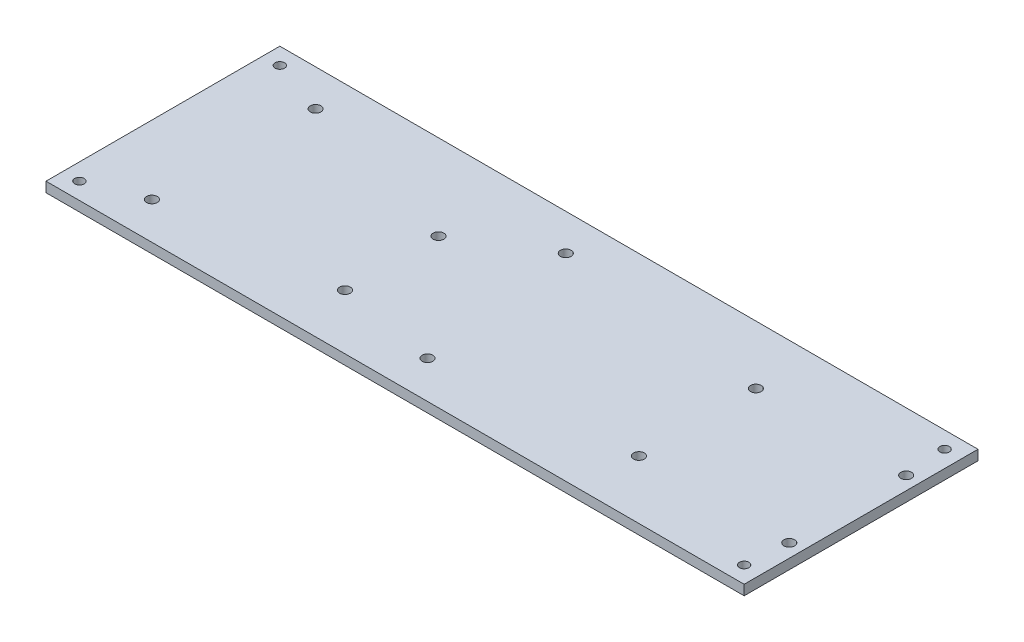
from build123d import *

# Parameters (mm, degrees)
SKETCH1_W           = 209
SKETCH1_H           = 70
BOSS_EXTRUDE1_DEPTH = 3
SKETCH2_R           = 1.6
CUT_EXTRUDE1_DEPTH  = 111.246315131
SKETCH3_R           = 1.6
CUT_EXTRUDE2_DEPTH  = 111.246315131
SKETCH4_R           = 1.42
CUT_EXTRUDE3_DEPTH  = 111.246315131


with BuildPart() as part:
    # Sketch1 → Boss-Extrude1 (new body)
    with BuildSketch(Plane(origin=(0, 0, 0), x_dir=(1, 0, 0), z_dir=(0, 1, 0))):
        Rectangle(SKETCH1_W, SKETCH1_H)
    extrude(amount=BOSS_EXTRUDE1_DEPTH)

    # Sketch2 → Cut-Extrude1 (cut, through all)
    with BuildSketch(Plane(origin=(0, 3, 0), x_dir=(1, 0, 0), z_dir=(0, 1, 0))):
        with Locations(Location((-82.9, 24.1, 0), (0, 0, 270))):
            Circle(SKETCH2_R)
        with Locations(Location((-83.9, -23.9, 0), (0, 0, 270))):
            Circle(SKETCH2_R)
        with Locations(Location((-8, 24.1, 0), (0, 0, 270))):
            Circle(SKETCH2_R)
        with Locations(Location((-1.5, -23.8, 0), (0, 0, 270))):
            Circle(SKETCH2_R)
        with Locations(Location((-31.5, 9.5, 0), (0, 0, 270))):
            Circle(SKETCH2_R)
        with Locations(Location((-31.5, -18.5, 0), (0, 0, 270))):
            Circle(SKETCH2_R)
    extrude(amount=-CUT_EXTRUDE1_DEPTH, mode=Mode.SUBTRACT)

    # Sketch3 → Cut-Extrude2 (cut, through all)
    with BuildSketch(Plane(origin=(0, 3, 0), x_dir=(1, 0, 0), z_dir=(0, 1, 0))):
        with Locations(Location((55.5, 17.5, 0), (0, 0, 270))):
            Circle(SKETCH3_R)
        with Locations(Location((55.5, -17.5, 0), (0, 0, 270))):
            Circle(SKETCH3_R)
        with Locations(Location((100.5, 17.5, 0), (0, 0, 270))):
            Circle(SKETCH3_R)
        with Locations(Location((100.5, -17.5, 0), (0, 0, 270))):
            Circle(SKETCH3_R)
    extrude(amount=-CUT_EXTRUDE2_DEPTH, mode=Mode.SUBTRACT)

    # Sketch4 → Cut-Extrude3 (cut, through all)
    with BuildSketch(Plane(origin=(0, 3, 0), x_dir=(1, 0, 0), z_dir=(0, 1, 0))):
        with Locations(Location((-99.5, 30, 0), (0, 0, 270))):
            Circle(SKETCH4_R)
        with Locations(Location((99.5, 30, 0), (0, 0, 90))):
            Circle(SKETCH4_R)
        with Locations(Location((99.5, -30, 0), (0, 0, 270))):
            Circle(SKETCH4_R)
        with Locations(Location((-99.5, -30, 0), (0, 0, 90))):
            Circle(SKETCH4_R)
    extrude(amount=-CUT_EXTRUDE3_DEPTH, mode=Mode.SUBTRACT)


solid = part.part
